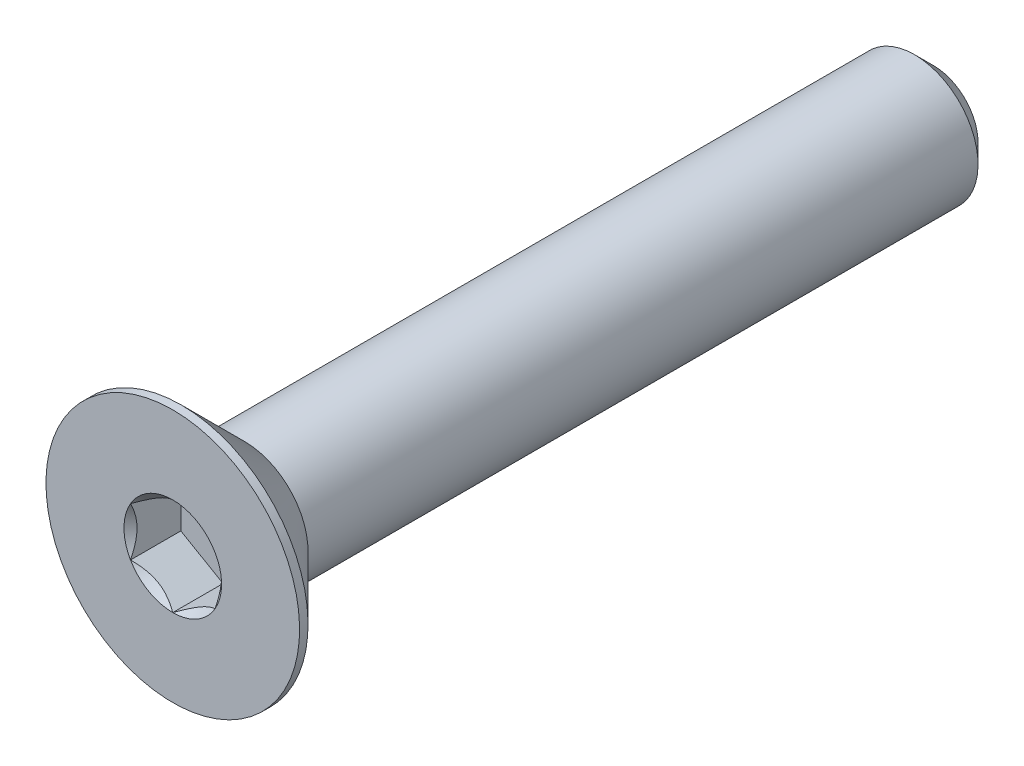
ISO-10303-21;
HEADER;
FILE_DESCRIPTION(('STEP AP214'),'2;1');
FILE_NAME('part.step','',(''),(''),'','','');
FILE_SCHEMA(('AUTOMOTIVE_DESIGN { 1 0 10303 214 1 1 1 1 }'));
ENDSEC;
DATA;
#1=APPLICATION_CONTEXT('core data for automotive mechanical design processes');
#2=APPLICATION_PROTOCOL_DEFINITION('international standard','automotive_design',2000,#1);
#3=PRODUCT_CONTEXT('',#1,'mechanical');
#4=PRODUCT('Part','Part','',(#3));
#5=PRODUCT_RELATED_PRODUCT_CATEGORY('part','',(#4));
#6=PRODUCT_DEFINITION_FORMATION('','',#4);
#7=PRODUCT_DEFINITION_CONTEXT('part definition',#1,'design');
#8=PRODUCT_DEFINITION('design','',#6,#7);
#9=PRODUCT_DEFINITION_SHAPE('','',#8);
#10=(LENGTH_UNIT() NAMED_UNIT(*) SI_UNIT(.MILLI.,.METRE.));
#11=(NAMED_UNIT(*) PLANE_ANGLE_UNIT() SI_UNIT($,.RADIAN.));
#12=(NAMED_UNIT(*) SI_UNIT($,.STERADIAN.) SOLID_ANGLE_UNIT());
#13=UNCERTAINTY_MEASURE_WITH_UNIT(LENGTH_MEASURE(1.E-05),#10,'distance_accuracy_value','');
#14=(GEOMETRIC_REPRESENTATION_CONTEXT(3) GLOBAL_UNCERTAINTY_ASSIGNED_CONTEXT((#13)) GLOBAL_UNIT_ASSIGNED_CONTEXT((#10,
#11,#12)) REPRESENTATION_CONTEXT('',''));
#15=CARTESIAN_POINT('',(0.,0.,0.));
#16=DIRECTION('',(0.,0.,1.));
#17=DIRECTION('',(1.,0.,0.));
#18=AXIS2_PLACEMENT_3D('',#15,#16,#17);
#19=CARTESIAN_POINT('',(0.,0.,-9.));
#20=DIRECTION('',(0.,0.,-1.));
#21=DIRECTION('',(0.,1.,0.));
#22=AXIS2_PLACEMENT_3D('',#19,#20,#21);
#23=CYLINDRICAL_SURFACE('',#22,1.5);
#24=CARTESIAN_POINT('',(0.,0.,7.3));
#25=DIRECTION('',(0.,0.,-1.));
#26=DIRECTION('',(0.,1.,0.));
#27=AXIS2_PLACEMENT_3D('',#24,#25,#26);
#28=CIRCLE('',#27,1.5);
#29=CARTESIAN_POINT('',(0.,1.5,7.3));
#30=VERTEX_POINT('',#29);
#31=EDGE_CURVE('E11',#30,#30,#28,.F.);
#32=ORIENTED_EDGE('',*,*,#31,.F.);
#33=EDGE_LOOP('',(#32));
#34=FACE_BOUND('',#33,.T.);
#35=CARTESIAN_POINT('',(0.,0.,-8.55));
#36=DIRECTION('',(0.,0.,-1.));
#37=DIRECTION('',(0.,1.,0.));
#38=AXIS2_PLACEMENT_3D('',#35,#36,#37);
#39=CIRCLE('',#38,1.5);
#40=CARTESIAN_POINT('',(0.,1.5,-8.55));
#41=VERTEX_POINT('',#40);
#42=EDGE_CURVE('E41',#41,#41,#39,.F.);
#43=ORIENTED_EDGE('',*,*,#42,.T.);
#44=EDGE_LOOP('',(#43));
#45=FACE_BOUND('',#44,.T.);
#46=ADVANCED_FACE('F33',(#34,#45),#23,.T.);
#47=CARTESIAN_POINT('',(0.,1.5,-9.));
#48=DIRECTION('',(0.,0.,-1.));
#49=DIRECTION('',(0.,1.,0.));
#50=AXIS2_PLACEMENT_3D('',#47,#48,#49);
#51=PLANE('',#50);
#52=CARTESIAN_POINT('',(0.,0.,-9.));
#53=DIRECTION('',(0.,0.,-1.));
#54=DIRECTION('',(0.,1.,0.));
#55=AXIS2_PLACEMENT_3D('',#52,#53,#54);
#56=CIRCLE('',#55,1.05);
#57=CARTESIAN_POINT('',(0.,1.05,-9.));
#58=VERTEX_POINT('',#57);
#59=EDGE_CURVE('E145',#58,#58,#56,.T.);
#60=ORIENTED_EDGE('',*,*,#59,.T.);
#61=EDGE_LOOP('',(#60));
#62=FACE_BOUND('',#61,.T.);
#63=ADVANCED_FACE('F154',(#62),#51,.T.);
#64=CARTESIAN_POINT('',(0.,0.,-9.));
#65=DIRECTION('',(0.,0.,1.));
#66=DIRECTION('',(0.,-1.,0.));
#67=AXIS2_PLACEMENT_3D('',#64,#65,#66);
#68=CONICAL_SURFACE('',#67,1.05,0.785398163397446);
#69=ORIENTED_EDGE('',*,*,#42,.F.);
#70=EDGE_LOOP('',(#69));
#71=FACE_BOUND('',#70,.T.);
#72=ORIENTED_EDGE('',*,*,#59,.F.);
#73=EDGE_LOOP('',(#72));
#74=FACE_BOUND('',#73,.T.);
#75=ADVANCED_FACE('F35',(#71,#74),#68,.T.);
#76=CARTESIAN_POINT('',(0.,0.,-9.));
#77=DIRECTION('',(0.,0.,-1.));
#78=DIRECTION('',(0.,1.,0.));
#79=AXIS2_PLACEMENT_3D('',#76,#77,#78);
#80=CYLINDRICAL_SURFACE('',#79,3.);
#81=CARTESIAN_POINT('',(0.,0.,9.));
#82=DIRECTION('',(0.,0.,-1.));
#83=DIRECTION('',(0.,1.,0.));
#84=AXIS2_PLACEMENT_3D('',#81,#82,#83);
#85=CIRCLE('',#84,3.);
#86=CARTESIAN_POINT('',(0.,3.,9.));
#87=VERTEX_POINT('',#86);
#88=EDGE_CURVE('E125',#87,#87,#85,.T.);
#89=ORIENTED_EDGE('',*,*,#88,.T.);
#90=EDGE_LOOP('',(#89));
#91=FACE_BOUND('',#90,.T.);
#92=CARTESIAN_POINT('',(0.,0.,8.79999999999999));
#93=DIRECTION('',(0.,0.,-1.));
#94=DIRECTION('',(0.,1.,0.));
#95=AXIS2_PLACEMENT_3D('',#92,#93,#94);
#96=CIRCLE('',#95,3.);
#97=CARTESIAN_POINT('',(0.,3.,8.79999999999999));
#98=VERTEX_POINT('',#97);
#99=EDGE_CURVE('E122',#98,#98,#96,.T.);
#100=ORIENTED_EDGE('',*,*,#99,.F.);
#101=EDGE_LOOP('',(#100));
#102=FACE_BOUND('',#101,.T.);
#103=ADVANCED_FACE('F153',(#91,#102),#80,.T.);
#104=CARTESIAN_POINT('',(0.,0.,7.3));
#105=DIRECTION('',(0.,0.,1.));
#106=DIRECTION('',(0.,-1.,0.));
#107=AXIS2_PLACEMENT_3D('',#104,#105,#106);
#108=CONICAL_SURFACE('',#107,1.5,0.785398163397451);
#109=ORIENTED_EDGE('',*,*,#99,.T.);
#110=EDGE_LOOP('',(#109));
#111=FACE_BOUND('',#110,.T.);
#112=ORIENTED_EDGE('',*,*,#31,.T.);
#113=EDGE_LOOP('',(#112));
#114=FACE_BOUND('',#113,.T.);
#115=ADVANCED_FACE('F167',(#111,#114),#108,.T.);
#116=CARTESIAN_POINT('',(0.,0.,9.));
#117=DIRECTION('',(0.,0.,1.));
#118=DIRECTION('',(0.,-1.,0.));
#119=AXIS2_PLACEMENT_3D('',#116,#117,#118);
#120=PLANE('',#119);
#121=CARTESIAN_POINT('',(0.,0.,9.));
#122=DIRECTION('',(0.,0.,1.));
#123=DIRECTION('',(1.,0.,0.));
#124=AXIS2_PLACEMENT_3D('',#121,#122,#123);
#125=CIRCLE('',#124,1.15470053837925);
#126=CARTESIAN_POINT('',(1.,0.577350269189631,9.));
#127=VERTEX_POINT('',#126);
#128=CARTESIAN_POINT('',(0.,1.15470053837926,9.));
#129=VERTEX_POINT('',#128);
#130=EDGE_CURVE('E92',#127,#129,#125,.T.);
#131=ORIENTED_EDGE('',*,*,#130,.F.);
#132=CARTESIAN_POINT('',(0.,0.,9.));
#133=DIRECTION('',(0.,0.,1.));
#134=DIRECTION('',(1.,0.,0.));
#135=AXIS2_PLACEMENT_3D('',#132,#133,#134);
#136=CIRCLE('',#135,1.15470053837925);
#137=CARTESIAN_POINT('',(0.999999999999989,-0.577350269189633,9.));
#138=VERTEX_POINT('',#137);
#139=EDGE_CURVE('E104',#138,#127,#136,.T.);
#140=ORIENTED_EDGE('',*,*,#139,.F.);
#141=CARTESIAN_POINT('',(0.,0.,9.));
#142=DIRECTION('',(0.,0.,1.));
#143=DIRECTION('',(1.,0.,0.));
#144=AXIS2_PLACEMENT_3D('',#141,#142,#143);
#145=CIRCLE('',#144,1.15470053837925);
#146=CARTESIAN_POINT('',(0.,-1.15470053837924,9.));
#147=VERTEX_POINT('',#146);
#148=EDGE_CURVE('E238',#147,#138,#145,.T.);
#149=ORIENTED_EDGE('',*,*,#148,.F.);
#150=CARTESIAN_POINT('',(0.,0.,9.));
#151=DIRECTION('',(0.,0.,1.));
#152=DIRECTION('',(1.,0.,0.));
#153=AXIS2_PLACEMENT_3D('',#150,#151,#152);
#154=CIRCLE('',#153,1.15470053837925);
#155=CARTESIAN_POINT('',(-1.,-0.577350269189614,9.));
#156=VERTEX_POINT('',#155);
#157=EDGE_CURVE('E117',#156,#147,#154,.T.);
#158=ORIENTED_EDGE('',*,*,#157,.F.);
#159=CARTESIAN_POINT('',(0.,0.,9.));
#160=DIRECTION('',(0.,0.,1.));
#161=DIRECTION('',(1.,0.,0.));
#162=AXIS2_PLACEMENT_3D('',#159,#160,#161);
#163=CIRCLE('',#162,1.15470053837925);
#164=CARTESIAN_POINT('',(-1.,0.577350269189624,9.));
#165=VERTEX_POINT('',#164);
#166=EDGE_CURVE('E239',#165,#156,#163,.T.);
#167=ORIENTED_EDGE('',*,*,#166,.F.);
#168=CARTESIAN_POINT('',(0.,0.,9.));
#169=DIRECTION('',(0.,0.,1.));
#170=DIRECTION('',(1.,0.,0.));
#171=AXIS2_PLACEMENT_3D('',#168,#169,#170);
#172=CIRCLE('',#171,1.15470053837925);
#173=EDGE_CURVE('E107',#129,#165,#172,.T.);
#174=ORIENTED_EDGE('',*,*,#173,.F.);
#175=EDGE_LOOP('',(#131,#140,#149,#158,#167,#174));
#176=FACE_BOUND('',#175,.T.);
#177=ORIENTED_EDGE('',*,*,#88,.F.);
#178=EDGE_LOOP('',(#177));
#179=FACE_BOUND('',#178,.T.);
#180=ADVANCED_FACE('F101',(#176,#179),#120,.T.);
#181=CARTESIAN_POINT('',(1.,0.577350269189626,7.81));
#182=DIRECTION('',(0.5,0.866025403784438,0.));
#183=DIRECTION('',(-0.866025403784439,0.5,0.));
#184=AXIS2_PLACEMENT_3D('',#181,#182,#183);
#185=PLANE('',#184);
#186=DIRECTION('',(0.,0.,1.));
#187=VECTOR('',#186,1.);
#188=CARTESIAN_POINT('',(1.,0.577350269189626,7.81));
#189=LINE('',#188,#187);
#190=CARTESIAN_POINT('',(1.,0.577350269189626,7.81));
#191=VERTEX_POINT('',#190);
#192=EDGE_CURVE('E48',#191,#127,#189,.T.);
#193=ORIENTED_EDGE('',*,*,#192,.T.);
#194=CARTESIAN_POINT('',(-0.000199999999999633,1.15481600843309,9.00011548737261));
#195=CARTESIAN_POINT('',(0.0341825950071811,1.13496520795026,8.98027793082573));
#196=CARTESIAN_POINT('',(0.0691401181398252,1.11478247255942,8.96160502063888));
#197=CARTESIAN_POINT('',(0.14042280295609,1.07362739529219,8.92741474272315));
#198=CARTESIAN_POINT('',(0.176754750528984,1.0526511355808,8.91191640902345));
#199=CARTESIAN_POINT('',(0.25001661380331,1.01035337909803,8.88536730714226));
#200=CARTESIAN_POINT('',(0.286927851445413,0.989042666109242,8.87424977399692));
#201=CARTESIAN_POINT('',(0.361562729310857,0.945952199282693,8.85711986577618));
#202=CARTESIAN_POINT('',(0.399284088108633,0.924173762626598,8.85109469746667));
#203=CARTESIAN_POINT('',(0.46429219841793,0.886641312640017,8.84566055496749));
#204=CARTESIAN_POINT('',(0.491494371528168,0.870936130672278,8.84485693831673));
#205=CARTESIAN_POINT('',(0.545846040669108,0.839556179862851,8.84620669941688));
#206=CARTESIAN_POINT('',(0.572995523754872,0.823881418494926,8.8483607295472));
#207=CARTESIAN_POINT('',(0.654056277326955,0.77708097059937,8.85911697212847));
#208=CARTESIAN_POINT('',(0.707564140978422,0.746188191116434,8.87201455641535));
#209=CARTESIAN_POINT('',(0.801476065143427,0.691968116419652,8.90314073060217));
#210=CARTESIAN_POINT('',(0.842320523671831,0.668386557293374,8.91973779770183));
#211=CARTESIAN_POINT('',(0.922409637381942,0.622147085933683,8.95712492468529));
#212=CARTESIAN_POINT('',(0.961659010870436,0.599486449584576,8.9779013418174));
#213=CARTESIAN_POINT('',(1.0002,0.577234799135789,9.00011548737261));
#214=B_SPLINE_CURVE_WITH_KNOTS('',3,(#194,#195,#196,#197,#198,#199,#200,#201,#202,#203,#204,
#205,#206,#207,#208,#209,#210,#211,#212,#213),.UNSPECIFIED.,.F.,.F.,(4,2,2,2,2,2,2,2,2,4),(0.,
0.133237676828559,0.267252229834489,0.399137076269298,0.530689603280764,0.624814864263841,
0.718960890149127,0.90730662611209,1.05710100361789,1.20641411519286),.UNSPECIFIED.);
#215=EDGE_CURVE('E89',#129,#127,#214,.T.);
#216=ORIENTED_EDGE('',*,*,#215,.F.);
#217=DIRECTION('',(0.,0.,1.));
#218=VECTOR('',#217,1.);
#219=CARTESIAN_POINT('',(0.,1.15470053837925,7.81));
#220=LINE('',#219,#218);
#221=CARTESIAN_POINT('',(0.,1.15470053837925,7.81));
#222=VERTEX_POINT('',#221);
#223=EDGE_CURVE('E141',#222,#129,#220,.T.);
#224=ORIENTED_EDGE('',*,*,#223,.F.);
#225=DIRECTION('',(-0.866025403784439,0.5,0.));
#226=VECTOR('',#225,1.);
#227=CARTESIAN_POINT('',(1.,0.577350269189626,7.81));
#228=LINE('',#227,#226);
#229=EDGE_CURVE('E114',#191,#222,#228,.T.);
#230=ORIENTED_EDGE('',*,*,#229,.F.);
#231=EDGE_LOOP('',(#193,#216,#224,#230));
#232=FACE_BOUND('',#231,.T.);
#233=ADVANCED_FACE('F119',(#232),#185,.F.);
#234=CARTESIAN_POINT('',(1.,-0.577350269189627,7.81));
#235=DIRECTION('',(1.,0.,0.));
#236=DIRECTION('',(0.,0.,-1.));
#237=AXIS2_PLACEMENT_3D('',#234,#235,#236);
#238=PLANE('',#237);
#239=DIRECTION('',(0.,0.,1.));
#240=VECTOR('',#239,1.);
#241=CARTESIAN_POINT('',(1.,-0.577350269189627,7.81));
#242=LINE('',#241,#240);
#243=CARTESIAN_POINT('',(1.,-0.577350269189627,7.81));
#244=VERTEX_POINT('',#243);
#245=EDGE_CURVE('E56',#244,#138,#242,.T.);
#246=ORIENTED_EDGE('',*,*,#245,.T.);
#247=CARTESIAN_POINT('',(1.,-1.15147208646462,9.37038567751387));
#248=CARTESIAN_POINT('',(1.,-1.12343447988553,9.34921991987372));
#249=CARTESIAN_POINT('',(1.,-1.09524064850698,9.32826169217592));
#250=CARTESIAN_POINT('',(1.,-1.03847715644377,9.28684602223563));
#251=CARTESIAN_POINT('',(1.,-1.00990740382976,9.26638870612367));
#252=CARTESIAN_POINT('',(1.,-0.923120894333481,9.20560479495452));
#253=CARTESIAN_POINT('',(1.,-0.864253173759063,9.16619222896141));
#254=CARTESIAN_POINT('',(1.,-0.740809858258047,9.08882066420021));
#255=CARTESIAN_POINT('',(1.,-0.676100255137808,9.05107303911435));
#256=CARTESIAN_POINT('',(1.,-0.543448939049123,8.9820245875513));
#257=CARTESIAN_POINT('',(1.,-0.475519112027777,8.95070202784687));
#258=CARTESIAN_POINT('',(1.,-0.373555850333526,8.9123817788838));
#259=CARTESIAN_POINT('',(1.,-0.341031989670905,8.90138359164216));
#260=CARTESIAN_POINT('',(1.,-0.27519907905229,8.88199834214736));
#261=CARTESIAN_POINT('',(1.,-0.241889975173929,8.8736114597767));
#262=CARTESIAN_POINT('',(1.,-0.175247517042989,8.86002522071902));
#263=CARTESIAN_POINT('',(1.,-0.141925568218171,8.85477079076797));
#264=CARTESIAN_POINT('',(1.,-0.0749144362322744,8.84754868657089));
#265=CARTESIAN_POINT('',(1.,-0.041225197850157,8.84558151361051));
#266=CARTESIAN_POINT('',(1.,0.0249580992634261,8.84508319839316));
#267=CARTESIAN_POINT('',(1.,0.0574512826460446,8.84643026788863));
#268=CARTESIAN_POINT('',(1.,0.122148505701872,8.85221648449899));
#269=CARTESIAN_POINT('',(1.,0.154352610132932,8.85665492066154));
#270=CARTESIAN_POINT('',(1.,0.218799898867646,8.8684568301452));
#271=CARTESIAN_POINT('',(1.,0.25103374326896,8.87587054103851));
#272=CARTESIAN_POINT('',(1.,0.314797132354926,8.89322894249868));
#273=CARTESIAN_POINT('',(1.,0.346326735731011,8.90317342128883));
#274=CARTESIAN_POINT('',(1.,0.445594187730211,8.93822348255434));
#275=CARTESIAN_POINT('',(1.,0.511919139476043,8.96732085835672));
#276=CARTESIAN_POINT('',(1.,0.641453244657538,9.0320153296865));
#277=CARTESIAN_POINT('',(1.,0.704650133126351,9.06763577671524));
#278=CARTESIAN_POINT('',(1.,0.825428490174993,9.14112390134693));
#279=CARTESIAN_POINT('',(1.,0.883132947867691,9.17879194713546));
#280=CARTESIAN_POINT('',(1.,0.968148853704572,9.23702285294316));
#281=CARTESIAN_POINT('',(1.,0.996120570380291,9.25663847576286));
#282=CARTESIAN_POINT('',(1.,1.05168177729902,9.29638851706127));
#283=CARTESIAN_POINT('',(1.,1.07927136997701,9.31652279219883));
#284=CARTESIAN_POINT('',(1.,1.1067018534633,9.33687211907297));
#285=B_SPLINE_CURVE_WITH_KNOTS('',3,(#247,#248,#249,#250,#251,#252,#253,#254,#255,#256,#257,
#258,#259,#260,#261,#262,#263,#264,#265,#266,#267,#268,#269,#270,#271,#272,#273,#274,#275,#276,
#277,#278,#279,#280,#281,#282,#283,#284),.UNSPECIFIED.,.F.,.F.,(4,2,2,2,2,2,2,2,2,2,2,2,2,2,2,2,
2,2,4),(0.,0.105386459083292,0.210799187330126,0.423233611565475,0.647793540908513,
0.871580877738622,0.974493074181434,1.07741235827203,1.17846428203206,1.27953161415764,
1.37694086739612,1.47432772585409,1.57343322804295,1.67253043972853,1.88917353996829,
2.10660791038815,2.31323734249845,2.41572589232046,2.51818641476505),.UNSPECIFIED.);
#286=EDGE_CURVE('E113',#127,#138,#285,.F.);
#287=ORIENTED_EDGE('',*,*,#286,.F.);
#288=ORIENTED_EDGE('',*,*,#192,.F.);
#289=DIRECTION('',(0.,1.,0.));
#290=VECTOR('',#289,1.);
#291=CARTESIAN_POINT('',(1.,-0.577350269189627,7.81));
#292=LINE('',#291,#290);
#293=EDGE_CURVE('E130',#244,#191,#292,.T.);
#294=ORIENTED_EDGE('',*,*,#293,.F.);
#295=EDGE_LOOP('',(#246,#287,#288,#294));
#296=FACE_BOUND('',#295,.T.);
#297=ADVANCED_FACE('F116',(#296),#238,.F.);
#298=CARTESIAN_POINT('',(0.,-1.15470053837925,7.81));
#299=DIRECTION('',(0.5,-0.866025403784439,0.));
#300=DIRECTION('',(0.866025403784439,0.5,0.));
#301=AXIS2_PLACEMENT_3D('',#298,#299,#300);
#302=PLANE('',#301);
#303=DIRECTION('',(0.,0.,1.));
#304=VECTOR('',#303,1.);
#305=CARTESIAN_POINT('',(0.,-1.15470053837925,7.81));
#306=LINE('',#305,#304);
#307=CARTESIAN_POINT('',(0.,-1.15470053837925,7.81));
#308=VERTEX_POINT('',#307);
#309=EDGE_CURVE('E127',#308,#147,#306,.T.);
#310=ORIENTED_EDGE('',*,*,#309,.T.);
#311=CARTESIAN_POINT('',(1.0002,-0.577234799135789,9.00011548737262));
#312=CARTESIAN_POINT('',(0.965817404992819,-0.597085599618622,8.98027793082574));
#313=CARTESIAN_POINT('',(0.930859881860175,-0.617268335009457,8.96160502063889));
#314=CARTESIAN_POINT('',(0.859577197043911,-0.658423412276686,8.92741474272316));
#315=CARTESIAN_POINT('',(0.823245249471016,-0.67939967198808,8.91191640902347));
#316=CARTESIAN_POINT('',(0.74998338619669,-0.721697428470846,8.88536730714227));
#317=CARTESIAN_POINT('',(0.713072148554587,-0.743008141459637,8.87424977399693));
#318=CARTESIAN_POINT('',(0.638437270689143,-0.786098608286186,8.85711986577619));
#319=CARTESIAN_POINT('',(0.600715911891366,-0.80787704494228,8.85109469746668));
#320=CARTESIAN_POINT('',(0.535707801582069,-0.845409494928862,8.8456605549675));
#321=CARTESIAN_POINT('',(0.50850562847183,-0.861114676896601,8.84485693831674));
#322=CARTESIAN_POINT('',(0.45415395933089,-0.892494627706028,8.84620669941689));
#323=CARTESIAN_POINT('',(0.427004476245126,-0.908169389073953,8.84836072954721));
#324=CARTESIAN_POINT('',(0.345943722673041,-0.95496983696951,8.85911697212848));
#325=CARTESIAN_POINT('',(0.292435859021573,-0.985862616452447,8.87201455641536));
#326=CARTESIAN_POINT('',(0.198523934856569,-1.04008269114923,8.90314073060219));
#327=CARTESIAN_POINT('',(0.157679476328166,-1.06366425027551,8.91973779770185));
#328=CARTESIAN_POINT('',(0.0775903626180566,-1.1099037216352,8.9571249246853));
#329=CARTESIAN_POINT('',(0.0383409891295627,-1.1325643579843,8.97790134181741));
#330=CARTESIAN_POINT('',(-0.000199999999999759,-1.15481600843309,9.00011548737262));
#331=B_SPLINE_CURVE_WITH_KNOTS('',3,(#311,#312,#313,#314,#315,#316,#317,#318,#319,#320,#321,
#322,#323,#324,#325,#326,#327,#328,#329,#330),.UNSPECIFIED.,.F.,.F.,(4,2,2,2,2,2,2,2,2,4),(0.,
0.133237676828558,0.267252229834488,0.399137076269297,0.530689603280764,0.624814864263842,
0.71896089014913,0.907306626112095,1.05710100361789,1.20641411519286),.UNSPECIFIED.);
#332=EDGE_CURVE('E236',#138,#147,#331,.T.);
#333=ORIENTED_EDGE('',*,*,#332,.F.);
#334=ORIENTED_EDGE('',*,*,#245,.F.);
#335=DIRECTION('',(0.866025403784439,0.5,0.));
#336=VECTOR('',#335,1.);
#337=CARTESIAN_POINT('',(0.,-1.15470053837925,7.81));
#338=LINE('',#337,#336);
#339=EDGE_CURVE('E228',#308,#244,#338,.T.);
#340=ORIENTED_EDGE('',*,*,#339,.F.);
#341=EDGE_LOOP('',(#310,#333,#334,#340));
#342=FACE_BOUND('',#341,.T.);
#343=ADVANCED_FACE('F192',(#342),#302,.F.);
#344=CARTESIAN_POINT('',(-1.,-0.577350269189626,7.81));
#345=DIRECTION('',(-0.5,-0.866025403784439,0.));
#346=DIRECTION('',(0.866025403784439,-0.5,0.));
#347=AXIS2_PLACEMENT_3D('',#344,#345,#346);
#348=PLANE('',#347);
#349=DIRECTION('',(0.,0.,1.));
#350=VECTOR('',#349,1.);
#351=CARTESIAN_POINT('',(-1.,-0.577350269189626,7.81));
#352=LINE('',#351,#350);
#353=CARTESIAN_POINT('',(-1.,-0.577350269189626,7.81));
#354=VERTEX_POINT('',#353);
#355=EDGE_CURVE('E135',#354,#156,#352,.T.);
#356=ORIENTED_EDGE('',*,*,#355,.T.);
#357=CARTESIAN_POINT('',(0.000199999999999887,-1.15481600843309,9.00011548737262));
#358=CARTESIAN_POINT('',(-0.0341825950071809,-1.13496520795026,8.98027793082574));
#359=CARTESIAN_POINT('',(-0.0691401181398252,-1.11478247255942,8.9616050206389));
#360=CARTESIAN_POINT('',(-0.14042280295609,-1.07362739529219,8.92741474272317));
#361=CARTESIAN_POINT('',(-0.176754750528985,-1.0526511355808,8.91191640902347));
#362=CARTESIAN_POINT('',(-0.250016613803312,-1.01035337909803,8.88536730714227));
#363=CARTESIAN_POINT('',(-0.286927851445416,-0.98904266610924,8.87424977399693));
#364=CARTESIAN_POINT('',(-0.361562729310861,-0.94595219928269,8.85711986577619));
#365=CARTESIAN_POINT('',(-0.399284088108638,-0.924173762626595,8.85109469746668));
#366=CARTESIAN_POINT('',(-0.464292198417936,-0.886641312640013,8.8456605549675));
#367=CARTESIAN_POINT('',(-0.491494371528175,-0.870936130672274,8.84485693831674));
#368=CARTESIAN_POINT('',(-0.545846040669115,-0.839556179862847,8.84620669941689));
#369=CARTESIAN_POINT('',(-0.572995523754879,-0.823881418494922,8.84836072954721));
#370=CARTESIAN_POINT('',(-0.654056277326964,-0.777080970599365,8.85911697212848));
#371=CARTESIAN_POINT('',(-0.707564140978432,-0.746188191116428,8.87201455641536));
#372=CARTESIAN_POINT('',(-0.801476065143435,-0.691968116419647,8.90314073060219));
#373=CARTESIAN_POINT('',(-0.842320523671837,-0.66838655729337,8.91973779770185));
#374=CARTESIAN_POINT('',(-0.922409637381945,-0.622147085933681,8.9571249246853));
#375=CARTESIAN_POINT('',(-0.961659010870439,-0.599486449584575,8.97790134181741));
#376=CARTESIAN_POINT('',(-1.0002,-0.577234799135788,9.00011548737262));
#377=B_SPLINE_CURVE_WITH_KNOTS('',3,(#357,#358,#359,#360,#361,#362,#363,#364,#365,#366,#367,
#368,#369,#370,#371,#372,#373,#374,#375,#376),.UNSPECIFIED.,.F.,.F.,(4,2,2,2,2,2,2,2,2,4),(0.,
0.133237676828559,0.267252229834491,0.399137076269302,0.530689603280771,0.624814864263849,
0.718960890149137,0.907306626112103,1.0571010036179,1.20641411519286),.UNSPECIFIED.);
#378=EDGE_CURVE('E210',#147,#156,#377,.T.);
#379=ORIENTED_EDGE('',*,*,#378,.F.);
#380=ORIENTED_EDGE('',*,*,#309,.F.);
#381=DIRECTION('',(0.866025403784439,-0.5,0.));
#382=VECTOR('',#381,1.);
#383=CARTESIAN_POINT('',(-1.,-0.577350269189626,7.81));
#384=LINE('',#383,#382);
#385=EDGE_CURVE('E226',#354,#308,#384,.T.);
#386=ORIENTED_EDGE('',*,*,#385,.F.);
#387=EDGE_LOOP('',(#356,#379,#380,#386));
#388=FACE_BOUND('',#387,.T.);
#389=ADVANCED_FACE('F188',(#388),#348,.F.);
#390=CARTESIAN_POINT('',(-1.,0.577350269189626,7.81));
#391=DIRECTION('',(-1.,0.,0.));
#392=DIRECTION('',(0.,-1.,0.));
#393=AXIS2_PLACEMENT_3D('',#390,#391,#392);
#394=PLANE('',#393);
#395=DIRECTION('',(0.,0.,1.));
#396=VECTOR('',#395,1.);
#397=CARTESIAN_POINT('',(-1.,0.577350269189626,7.81));
#398=LINE('',#397,#396);
#399=CARTESIAN_POINT('',(-1.,0.577350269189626,7.81));
#400=VERTEX_POINT('',#399);
#401=EDGE_CURVE('E138',#400,#165,#398,.T.);
#402=ORIENTED_EDGE('',*,*,#401,.T.);
#403=CARTESIAN_POINT('',(-1.,-1.15147208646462,9.37038567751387));
#404=CARTESIAN_POINT('',(-1.,-1.12343447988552,9.34921991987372));
#405=CARTESIAN_POINT('',(-1.,-1.09524064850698,9.32826169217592));
#406=CARTESIAN_POINT('',(-1.,-1.03847715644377,9.28684602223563));
#407=CARTESIAN_POINT('',(-1.,-1.00990740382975,9.26638870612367));
#408=CARTESIAN_POINT('',(-1.,-0.923120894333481,9.20560479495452));
#409=CARTESIAN_POINT('',(-1.,-0.864253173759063,9.16619222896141));
#410=CARTESIAN_POINT('',(-1.,-0.740809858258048,9.08882066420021));
#411=CARTESIAN_POINT('',(-1.,-0.676100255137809,9.05107303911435));
#412=CARTESIAN_POINT('',(-1.,-0.543448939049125,8.9820245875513));
#413=CARTESIAN_POINT('',(-1.,-0.475519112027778,8.95070202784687));
#414=CARTESIAN_POINT('',(-1.,-0.373555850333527,8.9123817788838));
#415=CARTESIAN_POINT('',(-1.,-0.341031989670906,8.90138359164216));
#416=CARTESIAN_POINT('',(-1.,-0.275199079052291,8.88199834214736));
#417=CARTESIAN_POINT('',(-1.,-0.24188997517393,8.8736114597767));
#418=CARTESIAN_POINT('',(-1.,-0.175247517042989,8.86002522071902));
#419=CARTESIAN_POINT('',(-1.,-0.141925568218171,8.85477079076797));
#420=CARTESIAN_POINT('',(-1.,-0.0749144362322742,8.84754868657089));
#421=CARTESIAN_POINT('',(-1.,-0.0412251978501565,8.84558151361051));
#422=CARTESIAN_POINT('',(-1.,0.0249580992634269,8.84508319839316));
#423=CARTESIAN_POINT('',(-1.,0.0574512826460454,8.84643026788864));
#424=CARTESIAN_POINT('',(-1.,0.122148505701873,8.85221648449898));
#425=CARTESIAN_POINT('',(-1.,0.154352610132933,8.85665492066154));
#426=CARTESIAN_POINT('',(-1.,0.218799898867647,8.8684568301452));
#427=CARTESIAN_POINT('',(-1.,0.251033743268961,8.87587054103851));
#428=CARTESIAN_POINT('',(-1.,0.314797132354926,8.89322894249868));
#429=CARTESIAN_POINT('',(-1.,0.346326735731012,8.90317342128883));
#430=CARTESIAN_POINT('',(-1.,0.445594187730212,8.93822348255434));
#431=CARTESIAN_POINT('',(-1.,0.511919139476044,8.96732085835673));
#432=CARTESIAN_POINT('',(-1.,0.641453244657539,9.03201532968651));
#433=CARTESIAN_POINT('',(-1.,0.704650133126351,9.06763577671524));
#434=CARTESIAN_POINT('',(-1.,0.825428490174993,9.14112390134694));
#435=CARTESIAN_POINT('',(-1.,0.883132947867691,9.17879194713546));
#436=CARTESIAN_POINT('',(-1.,0.968148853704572,9.23702285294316));
#437=CARTESIAN_POINT('',(-1.,0.996120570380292,9.25663847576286));
#438=CARTESIAN_POINT('',(-1.,1.05168177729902,9.29638851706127));
#439=CARTESIAN_POINT('',(-1.,1.07927136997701,9.31652279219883));
#440=CARTESIAN_POINT('',(-1.,1.1067018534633,9.33687211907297));
#441=B_SPLINE_CURVE_WITH_KNOTS('',3,(#403,#404,#405,#406,#407,#408,#409,#410,#411,#412,#413,
#414,#415,#416,#417,#418,#419,#420,#421,#422,#423,#424,#425,#426,#427,#428,#429,#430,#431,#432,
#433,#434,#435,#436,#437,#438,#439,#440),.UNSPECIFIED.,.F.,.F.,(4,2,2,2,2,2,2,2,2,2,2,2,2,2,2,2,
2,2,4),(0.,0.105386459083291,0.210799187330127,0.423233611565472,0.64779354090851,
0.871580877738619,0.974493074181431,1.07741235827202,1.17846428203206,1.27953161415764,
1.37694086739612,1.47432772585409,1.57343322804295,1.67253043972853,1.88917353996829,
2.10660791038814,2.31323734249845,2.41572589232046,2.51818641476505),.UNSPECIFIED.);
#442=EDGE_CURVE('E95',#156,#165,#441,.T.);
#443=ORIENTED_EDGE('',*,*,#442,.F.);
#444=ORIENTED_EDGE('',*,*,#355,.F.);
#445=DIRECTION('',(0.,-1.,0.));
#446=VECTOR('',#445,1.);
#447=CARTESIAN_POINT('',(-1.,0.577350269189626,7.81));
#448=LINE('',#447,#446);
#449=EDGE_CURVE('E223',#400,#354,#448,.T.);
#450=ORIENTED_EDGE('',*,*,#449,.F.);
#451=EDGE_LOOP('',(#402,#443,#444,#450));
#452=FACE_BOUND('',#451,.T.);
#453=ADVANCED_FACE('F184',(#452),#394,.F.);
#454=CARTESIAN_POINT('',(0.,1.15470053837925,7.81));
#455=DIRECTION('',(-0.5,0.866025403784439,0.));
#456=DIRECTION('',(-0.866025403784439,-0.5,0.));
#457=AXIS2_PLACEMENT_3D('',#454,#455,#456);
#458=PLANE('',#457);
#459=ORIENTED_EDGE('',*,*,#223,.T.);
#460=CARTESIAN_POINT('',(-1.0002,0.577234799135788,9.00011548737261));
#461=CARTESIAN_POINT('',(-0.965817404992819,0.597085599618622,8.98027793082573));
#462=CARTESIAN_POINT('',(-0.930859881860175,0.617268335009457,8.96160502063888));
#463=CARTESIAN_POINT('',(-0.85957719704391,0.658423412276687,8.92741474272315));
#464=CARTESIAN_POINT('',(-0.823245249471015,0.679399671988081,8.91191640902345));
#465=CARTESIAN_POINT('',(-0.749983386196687,0.721697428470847,8.88536730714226));
#466=CARTESIAN_POINT('',(-0.713072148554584,0.743008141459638,8.87424977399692));
#467=CARTESIAN_POINT('',(-0.638437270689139,0.786098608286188,8.85711986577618));
#468=CARTESIAN_POINT('',(-0.600715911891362,0.807877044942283,8.85109469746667));
#469=CARTESIAN_POINT('',(-0.535707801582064,0.845409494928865,8.84566055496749));
#470=CARTESIAN_POINT('',(-0.508505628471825,0.861114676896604,8.84485693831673));
#471=CARTESIAN_POINT('',(-0.454153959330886,0.892494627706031,8.84620669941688));
#472=CARTESIAN_POINT('',(-0.427004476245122,0.908169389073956,8.84836072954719));
#473=CARTESIAN_POINT('',(-0.345943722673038,0.954969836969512,8.85911697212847));
#474=CARTESIAN_POINT('',(-0.292435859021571,0.985862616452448,8.87201455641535));
#475=CARTESIAN_POINT('',(-0.198523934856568,1.04008269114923,8.90314073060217));
#476=CARTESIAN_POINT('',(-0.157679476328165,1.06366425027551,8.91973779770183));
#477=CARTESIAN_POINT('',(-0.077590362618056,1.1099037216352,8.95712492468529));
#478=CARTESIAN_POINT('',(-0.0383409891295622,1.1325643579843,8.9779013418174));
#479=CARTESIAN_POINT('',(0.000199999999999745,1.15481600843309,9.00011548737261));
#480=B_SPLINE_CURVE_WITH_KNOTS('',3,(#460,#461,#462,#463,#464,#465,#466,#467,#468,#469,#470,
#471,#472,#473,#474,#475,#476,#477,#478,#479),.UNSPECIFIED.,.F.,.F.,(4,2,2,2,2,2,2,2,2,4),(0.,
0.133237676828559,0.267252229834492,0.399137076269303,0.530689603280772,0.624814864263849,
0.718960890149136,0.907306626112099,1.05710100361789,1.20641411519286),.UNSPECIFIED.);
#481=EDGE_CURVE('E232',#165,#129,#480,.T.);
#482=ORIENTED_EDGE('',*,*,#481,.F.);
#483=ORIENTED_EDGE('',*,*,#401,.F.);
#484=DIRECTION('',(-0.866025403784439,-0.5,0.));
#485=VECTOR('',#484,1.);
#486=CARTESIAN_POINT('',(0.,1.15470053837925,7.81));
#487=LINE('',#486,#485);
#488=EDGE_CURVE('E220',#222,#400,#487,.T.);
#489=ORIENTED_EDGE('',*,*,#488,.F.);
#490=EDGE_LOOP('',(#459,#482,#483,#489));
#491=FACE_BOUND('',#490,.T.);
#492=ADVANCED_FACE('F180',(#491),#458,.F.);
#493=CARTESIAN_POINT('',(0.,0.,7.81));
#494=DIRECTION('',(0.,0.,1.));
#495=DIRECTION('',(1.,0.,0.));
#496=AXIS2_PLACEMENT_3D('',#493,#494,#495);
#497=PLANE('',#496);
#498=ORIENTED_EDGE('',*,*,#229,.T.);
#499=ORIENTED_EDGE('',*,*,#488,.T.);
#500=ORIENTED_EDGE('',*,*,#449,.T.);
#501=ORIENTED_EDGE('',*,*,#385,.T.);
#502=ORIENTED_EDGE('',*,*,#339,.T.);
#503=ORIENTED_EDGE('',*,*,#293,.T.);
#504=EDGE_LOOP('',(#498,#499,#500,#501,#502,#503));
#505=FACE_BOUND('',#504,.T.);
#506=ADVANCED_FACE('F183',(#505),#497,.T.);
#507=CARTESIAN_POINT('',(0.,0.,9.));
#508=DIRECTION('',(0.,0.,1.));
#509=DIRECTION('',(1.,0.,0.));
#510=AXIS2_PLACEMENT_3D('',#507,#508,#509);
#511=CONICAL_SURFACE('',#510,1.15470053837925,0.78539816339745);
#512=ORIENTED_EDGE('',*,*,#481,.T.);
#513=ORIENTED_EDGE('',*,*,#173,.T.);
#514=EDGE_LOOP('',(#512,#513));
#515=FACE_BOUND('',#514,.T.);
#516=ADVANCED_FACE('F200',(#515),#511,.F.);
#517=CARTESIAN_POINT('',(0.,0.,9.));
#518=DIRECTION('',(0.,0.,1.));
#519=DIRECTION('',(1.,0.,0.));
#520=AXIS2_PLACEMENT_3D('',#517,#518,#519);
#521=CONICAL_SURFACE('',#520,1.15470053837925,0.78539816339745);
#522=ORIENTED_EDGE('',*,*,#378,.T.);
#523=ORIENTED_EDGE('',*,*,#157,.T.);
#524=EDGE_LOOP('',(#522,#523));
#525=FACE_BOUND('',#524,.T.);
#526=ADVANCED_FACE('F202',(#525),#521,.F.);
#527=CARTESIAN_POINT('',(0.,0.,9.));
#528=DIRECTION('',(0.,0.,1.));
#529=DIRECTION('',(1.,0.,0.));
#530=AXIS2_PLACEMENT_3D('',#527,#528,#529);
#531=CONICAL_SURFACE('',#530,1.15470053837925,0.78539816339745);
#532=ORIENTED_EDGE('',*,*,#286,.T.);
#533=ORIENTED_EDGE('',*,*,#139,.T.);
#534=EDGE_LOOP('',(#532,#533));
#535=FACE_BOUND('',#534,.T.);
#536=ADVANCED_FACE('F112',(#535),#531,.F.);
#537=CARTESIAN_POINT('',(0.,0.,9.));
#538=DIRECTION('',(0.,0.,1.));
#539=DIRECTION('',(1.,0.,0.));
#540=AXIS2_PLACEMENT_3D('',#537,#538,#539);
#541=CONICAL_SURFACE('',#540,1.15470053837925,0.78539816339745);
#542=ORIENTED_EDGE('',*,*,#332,.T.);
#543=ORIENTED_EDGE('',*,*,#148,.T.);
#544=EDGE_LOOP('',(#542,#543));
#545=FACE_BOUND('',#544,.T.);
#546=ADVANCED_FACE('F251',(#545),#541,.F.);
#547=CARTESIAN_POINT('',(0.,0.,9.));
#548=DIRECTION('',(0.,0.,1.));
#549=DIRECTION('',(1.,0.,0.));
#550=AXIS2_PLACEMENT_3D('',#547,#548,#549);
#551=CONICAL_SURFACE('',#550,1.15470053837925,0.78539816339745);
#552=ORIENTED_EDGE('',*,*,#442,.T.);
#553=ORIENTED_EDGE('',*,*,#166,.T.);
#554=EDGE_LOOP('',(#552,#553));
#555=FACE_BOUND('',#554,.T.);
#556=ADVANCED_FACE('F256',(#555),#551,.F.);
#557=CARTESIAN_POINT('',(0.,0.,9.));
#558=DIRECTION('',(0.,0.,1.));
#559=DIRECTION('',(1.,0.,0.));
#560=AXIS2_PLACEMENT_3D('',#557,#558,#559);
#561=CONICAL_SURFACE('',#560,1.15470053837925,0.78539816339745);
#562=ORIENTED_EDGE('',*,*,#215,.T.);
#563=ORIENTED_EDGE('',*,*,#130,.T.);
#564=EDGE_LOOP('',(#562,#563));
#565=FACE_BOUND('',#564,.T.);
#566=ADVANCED_FACE('F91',(#565),#561,.F.);
#567=CLOSED_SHELL('',(#46,#63,#75,#103,#115,#180,#233,#297,#343,#389,#453,#492,#506,#516,#526,
#536,#546,#556,#566));
#568=MANIFOLD_SOLID_BREP('B2',#567);
#569=ADVANCED_BREP_SHAPE_REPRESENTATION('',(#18,#568),#14);
#570=SHAPE_DEFINITION_REPRESENTATION(#9,#569);
ENDSEC;
END-ISO-10303-21;
